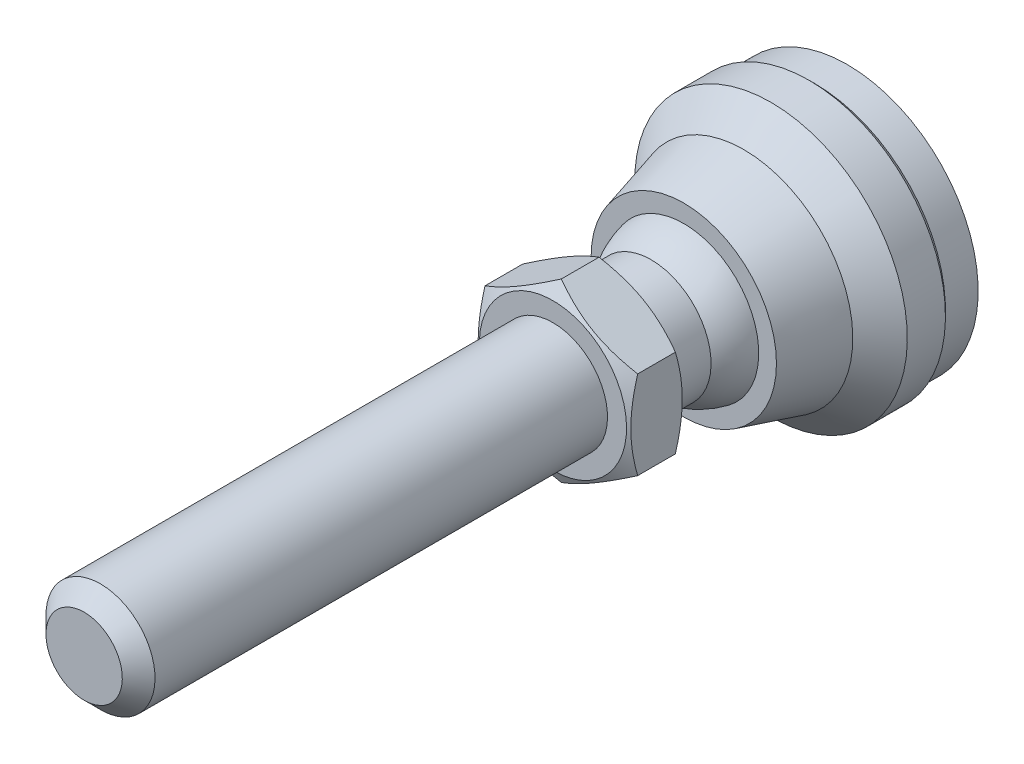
ISO-10303-21;
HEADER;
FILE_DESCRIPTION(('STEP AP214'),'2;1');
FILE_NAME('part.step','',(''),(''),'','','');
FILE_SCHEMA(('AUTOMOTIVE_DESIGN { 1 0 10303 214 1 1 1 1 }'));
ENDSEC;
DATA;
#1=APPLICATION_CONTEXT('core data for automotive mechanical design processes');
#2=APPLICATION_PROTOCOL_DEFINITION('international standard','automotive_design',2000,#1);
#3=PRODUCT_CONTEXT('',#1,'mechanical');
#4=PRODUCT('Part','Part','',(#3));
#5=PRODUCT_RELATED_PRODUCT_CATEGORY('part','',(#4));
#6=PRODUCT_DEFINITION_FORMATION('','',#4);
#7=PRODUCT_DEFINITION_CONTEXT('part definition',#1,'design');
#8=PRODUCT_DEFINITION('design','',#6,#7);
#9=PRODUCT_DEFINITION_SHAPE('','',#8);
#10=(LENGTH_UNIT() NAMED_UNIT(*) SI_UNIT(.MILLI.,.METRE.));
#11=(NAMED_UNIT(*) PLANE_ANGLE_UNIT() SI_UNIT($,.RADIAN.));
#12=(NAMED_UNIT(*) SI_UNIT($,.STERADIAN.) SOLID_ANGLE_UNIT());
#13=UNCERTAINTY_MEASURE_WITH_UNIT(LENGTH_MEASURE(1.E-05),#10,'distance_accuracy_value','');
#14=(GEOMETRIC_REPRESENTATION_CONTEXT(3) GLOBAL_UNCERTAINTY_ASSIGNED_CONTEXT((#13)) GLOBAL_UNIT_ASSIGNED_CONTEXT((#10,
#11,#12)) REPRESENTATION_CONTEXT('',''));
#15=CARTESIAN_POINT('',(0.,0.,0.));
#16=DIRECTION('',(0.,0.,1.));
#17=DIRECTION('',(1.,0.,0.));
#18=AXIS2_PLACEMENT_3D('',#15,#16,#17);
#19=CARTESIAN_POINT('',(-5.49999999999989,0.,22.));
#20=DIRECTION('',(0.,0.,1.));
#21=DIRECTION('',(0.,-1.,0.));
#22=AXIS2_PLACEMENT_3D('',#19,#20,#21);
#23=PLANE('',#22);
#24=CARTESIAN_POINT('',(0.,0.,21.9999999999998));
#25=DIRECTION('',(0.,0.,1.));
#26=DIRECTION('',(0.,-1.,0.));
#27=AXIS2_PLACEMENT_3D('',#24,#25,#26);
#28=CIRCLE('',#27,6.75);
#29=CARTESIAN_POINT('',(0.,-6.75,21.9999999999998));
#30=VERTEX_POINT('',#29);
#31=EDGE_CURVE('E440',#30,#30,#28,.T.);
#32=ORIENTED_EDGE('',*,*,#31,.F.);
#33=EDGE_LOOP('',(#32));
#34=FACE_BOUND('',#33,.T.);
#35=CARTESIAN_POINT('',(0.,0.,22.));
#36=DIRECTION('',(0.,0.,-1.));
#37=DIRECTION('',(0.,1.,0.));
#38=AXIS2_PLACEMENT_3D('',#35,#36,#37);
#39=CIRCLE('',#38,5.49999999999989);
#40=CARTESIAN_POINT('',(0.,5.49999999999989,22.));
#41=VERTEX_POINT('',#40);
#42=EDGE_CURVE('E120',#41,#41,#39,.T.);
#43=ORIENTED_EDGE('',*,*,#42,.F.);
#44=EDGE_LOOP('',(#43));
#45=FACE_BOUND('',#44,.T.);
#46=ADVANCED_FACE('F14',(#34,#45),#23,.F.);
#47=CARTESIAN_POINT('',(0.,0.,0.));
#48=DIRECTION('',(0.,0.,-1.));
#49=DIRECTION('',(0.,1.,0.));
#50=AXIS2_PLACEMENT_3D('',#47,#48,#49);
#51=CYLINDRICAL_SURFACE('',#50,5.49999999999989);
#52=CARTESIAN_POINT('',(0.,0.,18.));
#53=DIRECTION('',(0.,0.,-1.));
#54=DIRECTION('',(0.,1.,0.));
#55=AXIS2_PLACEMENT_3D('',#52,#53,#54);
#56=CIRCLE('',#55,5.49999999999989);
#57=CARTESIAN_POINT('',(-5.49999999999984,0.,18.));
#58=VERTEX_POINT('',#57);
#59=EDGE_CURVE('E117',#58,#58,#56,.T.);
#60=ORIENTED_EDGE('',*,*,#59,.F.);
#61=EDGE_LOOP('',(#60));
#62=FACE_BOUND('',#61,.T.);
#63=ORIENTED_EDGE('',*,*,#42,.T.);
#64=EDGE_LOOP('',(#63));
#65=FACE_BOUND('',#64,.T.);
#66=ADVANCED_FACE('F144',(#62,#65),#51,.T.);
#67=CARTESIAN_POINT('',(1.11022302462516E-13,0.,13.6698729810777));
#68=DIRECTION('',(0.,0.,-1.));
#69=DIRECTION('',(-1.,0.,0.));
#70=AXIS2_PLACEMENT_3D('',#67,#68,#69);
#71=SPHERICAL_SURFACE('',#70,7.);
#72=CARTESIAN_POINT('',(0.,0.,15.));
#73=DIRECTION('',(0.,0.,-1.));
#74=DIRECTION('',(0.,1.,0.));
#75=AXIS2_PLACEMENT_3D('',#72,#73,#74);
#76=CIRCLE('',#75,6.87246404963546);
#77=CARTESIAN_POINT('',(-6.87246404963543,0.,15.));
#78=VERTEX_POINT('',#77);
#79=EDGE_CURVE('E114',#78,#78,#76,.T.);
#80=CARTESIAN_POINT('',(-6.87246404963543,0.,15.));
#81=CARTESIAN_POINT('',(-6.86587210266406,0.,15.0340591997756));
#82=CARTESIAN_POINT('',(-6.85902692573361,0.,15.0680693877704));
#83=CARTESIAN_POINT('',(-6.84483171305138,0.,15.1359842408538));
#84=CARTESIAN_POINT('',(-6.8374816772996,0.,15.1698889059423));
#85=CARTESIAN_POINT('',(-6.82227834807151,0.,15.2375852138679));
#86=CARTESIAN_POINT('',(-6.8144250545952,0.,15.2713768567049));
#87=CARTESIAN_POINT('',(-6.79821695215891,0.,15.3388396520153));
#88=CARTESIAN_POINT('',(-6.78986214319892,0.,15.3725108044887));
#89=CARTESIAN_POINT('',(-6.77265285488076,0.,15.4397251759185));
#90=CARTESIAN_POINT('',(-6.76379837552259,0.,15.473268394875));
#91=CARTESIAN_POINT('',(-6.74559170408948,0.,15.5402194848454));
#92=CARTESIAN_POINT('',(-6.73623951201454,0.,15.5736273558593));
#93=CARTESIAN_POINT('',(-6.71703948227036,0.,15.6403003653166));
#94=CARTESIAN_POINT('',(-6.70719164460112,0.,15.67356550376));
#95=CARTESIAN_POINT('',(-6.68700250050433,0.,15.7399456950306));
#96=CARTESIAN_POINT('',(-6.67666119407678,0.,15.7730607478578));
#97=CARTESIAN_POINT('',(-6.65548739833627,0.,15.8391334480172));
#98=CARTESIAN_POINT('',(-6.6446549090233,0.,15.8720910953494));
#99=CARTESIAN_POINT('',(-6.62250114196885,0.,15.9378416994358));
#100=CARTESIAN_POINT('',(-6.61117986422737,0.,15.9706346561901));
#101=CARTESIAN_POINT('',(-6.58805102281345,0.,16.0360486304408));
#102=CARTESIAN_POINT('',(-6.57624345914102,0.,16.0686696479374));
#103=CARTESIAN_POINT('',(-6.55214465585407,0.,16.1337325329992));
#104=CARTESIAN_POINT('',(-6.53985341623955,0.,16.1661744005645));
#105=CARTESIAN_POINT('',(-6.51478997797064,0.,16.2308718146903));
#106=CARTESIAN_POINT('',(-6.50201777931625,0.,16.2631273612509));
#107=CARTESIAN_POINT('',(-6.47599524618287,0.,16.3274450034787));
#108=CARTESIAN_POINT('',(-6.46274491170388,0.,16.3595070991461));
#109=CARTESIAN_POINT('',(-6.43576903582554,0.,16.4234307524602));
#110=CARTESIAN_POINT('',(-6.42204349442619,0.,16.455292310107));
#111=CARTESIAN_POINT('',(-6.39412023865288,0.,16.5188078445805));
#112=CARTESIAN_POINT('',(-6.37992252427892,0.,16.5504618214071));
#113=CARTESIAN_POINT('',(-6.35105806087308,0.,16.6135551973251));
#114=CARTESIAN_POINT('',(-6.33639131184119,0.,16.6449945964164));
#115=CARTESIAN_POINT('',(-6.30659202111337,0.,16.7076518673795));
#116=CARTESIAN_POINT('',(-6.29145947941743,0.,16.7388697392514));
#117=CARTESIAN_POINT('',(-6.26073194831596,0.,16.8010770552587));
#118=CARTESIAN_POINT('',(-6.24513695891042,0.,16.8320664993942));
#119=CARTESIAN_POINT('',(-6.2134879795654,0.,16.8938101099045));
#120=CARTESIAN_POINT('',(-6.19743398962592,0.,16.9245642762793));
#121=CARTESIAN_POINT('',(-6.16487055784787,0.,16.9858305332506));
#122=CARTESIAN_POINT('',(-6.14836111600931,0.,17.016342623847));
#123=CARTESIAN_POINT('',(-6.11489042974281,0.,17.0771179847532));
#124=CARTESIAN_POINT('',(-6.09792918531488,0.,17.107381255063));
#125=CARTESIAN_POINT('',(-6.06355864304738,0.,17.1676522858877));
#126=CARTESIAN_POINT('',(-6.0461493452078,0.,17.1976600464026));
#127=CARTESIAN_POINT('',(-6.01088654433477,0.,17.2574134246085));
#128=CARTESIAN_POINT('',(-5.99303304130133,0.,17.2871590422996));
#129=CARTESIAN_POINT('',(-5.95688577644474,0.,17.3463815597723));
#130=CARTESIAN_POINT('',(-5.9385920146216,0.,17.3758584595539));
#131=CARTESIAN_POINT('',(-5.90156827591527,0.,17.4345370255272));
#132=CARTESIAN_POINT('',(-5.88283829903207,0.,17.4637386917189));
#133=CARTESIAN_POINT('',(-5.84494627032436,0.,17.5218603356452));
#134=CARTESIAN_POINT('',(-5.82578421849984,0.,17.5507803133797));
#135=CARTESIAN_POINT('',(-5.78703227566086,0.,17.6083321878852));
#136=CARTESIAN_POINT('',(-5.7674423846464,0.,17.6369640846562));
#137=CARTESIAN_POINT('',(-5.72783909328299,0.,17.6939334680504));
#138=CARTESIAN_POINT('',(-5.70782569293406,0.,17.7222709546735));
#139=CARTESIAN_POINT('',(-5.66737980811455,0.,17.778645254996));
#140=CARTESIAN_POINT('',(-5.64694732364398,0.,17.8066820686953));
#141=CARTESIAN_POINT('',(-5.60566778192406,0.,17.862448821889));
#142=CARTESIAN_POINT('',(-5.58482072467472,0.,17.8901787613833));
#143=CARTESIAN_POINT('',(-5.5427166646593,0.,17.9453256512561));
#144=CARTESIAN_POINT('',(-5.52145966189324,0.,17.9727426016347));
#145=CARTESIAN_POINT('',(-5.49999999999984,0.,18.));
#146=B_SPLINE_CURVE_WITH_KNOTS('',3,(#80,#81,#82,#83,#84,#85,#86,#87,#88,#89,#90,#91,#92,#93,
#94,#95,#96,#97,#98,#99,#100,#101,#102,#103,#104,#105,#106,#107,#108,#109,#110,#111,#112,#113,
#114,#115,#116,#117,#118,#119,#120,#121,#122,#123,#124,#125,#126,#127,#128,#129,#130,#131,#132,
#133,#134,#135,#136,#137,#138,#139,#140,#141,#142,#143,#144,#145),.UNSPECIFIED.,.F.,.F.,(4,2,2,
2,2,2,2,2,2,2,2,2,2,2,2,2,2,2,2,2,2,2,2,2,2,2,2,2,2,2,2,2,4),(0.,0.104072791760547,
0.208145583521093,0.312218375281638,0.416291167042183,0.520363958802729,0.624436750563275,
0.728509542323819,0.832582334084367,0.936655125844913,1.04072791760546,1.144800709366,
1.24887350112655,1.3529462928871,1.45701908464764,1.56109187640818,1.66516466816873,
1.76923745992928,1.87331025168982,1.97738304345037,2.08145583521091,2.18552862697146,
2.28960141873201,2.39367421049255,2.4977470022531,2.60181979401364,2.70589258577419,
2.80996537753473,2.91403816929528,3.01811096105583,3.12218375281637,3.22625654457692,
3.33032933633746),.UNSPECIFIED.);
#147=EDGE_CURVE('BSEAM151',#78,#58,#146,.T.);
#148=ORIENTED_EDGE('',*,*,#79,.F.);
#149=ORIENTED_EDGE('',*,*,#59,.T.);
#150=ORIENTED_EDGE('',*,*,#147,.T.);
#151=ORIENTED_EDGE('',*,*,#147,.F.);
#152=EDGE_LOOP('',(#148,#150,#149,#151));
#153=FACE_BOUND('',#152,.T.);
#154=ADVANCED_FACE('F151',(#153),#71,.T.);
#155=CARTESIAN_POINT('',(-8.5,0.,15.));
#156=DIRECTION('',(0.,0.,-1.));
#157=DIRECTION('',(0.,1.,0.));
#158=AXIS2_PLACEMENT_3D('',#155,#156,#157);
#159=PLANE('',#158);
#160=CARTESIAN_POINT('',(0.,0.,15.));
#161=DIRECTION('',(0.,0.,-1.));
#162=DIRECTION('',(0.,1.,0.));
#163=AXIS2_PLACEMENT_3D('',#160,#161,#162);
#164=CIRCLE('',#163,8.5);
#165=CARTESIAN_POINT('',(0.,8.5,15.));
#166=VERTEX_POINT('',#165);
#167=EDGE_CURVE('E111',#166,#166,#164,.T.);
#168=ORIENTED_EDGE('',*,*,#167,.F.);
#169=EDGE_LOOP('',(#168));
#170=FACE_BOUND('',#169,.T.);
#171=ORIENTED_EDGE('',*,*,#79,.T.);
#172=EDGE_LOOP('',(#171));
#173=FACE_BOUND('',#172,.T.);
#174=ADVANCED_FACE('F303',(#170,#173),#159,.F.);
#175=CARTESIAN_POINT('',(0.,0.,15.));
#176=DIRECTION('',(0.,0.,-1.));
#177=DIRECTION('',(0.,1.,0.));
#178=AXIS2_PLACEMENT_3D('',#175,#176,#177);
#179=CONICAL_SURFACE('',#178,8.5,0.266252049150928);
#180=CARTESIAN_POINT('',(0.,0.,9.5));
#181=DIRECTION('',(0.,0.,-1.));
#182=DIRECTION('',(0.,1.,0.));
#183=AXIS2_PLACEMENT_3D('',#180,#181,#182);
#184=CIRCLE('',#183,10.);
#185=CARTESIAN_POINT('',(0.,10.,9.5));
#186=VERTEX_POINT('',#185);
#187=EDGE_CURVE('E108',#186,#186,#184,.T.);
#188=ORIENTED_EDGE('',*,*,#187,.F.);
#189=EDGE_LOOP('',(#188));
#190=FACE_BOUND('',#189,.T.);
#191=ORIENTED_EDGE('',*,*,#167,.T.);
#192=EDGE_LOOP('',(#191));
#193=FACE_BOUND('',#192,.T.);
#194=ADVANCED_FACE('F293',(#190,#193),#179,.T.);
#195=CARTESIAN_POINT('',(0.,0.,9.5));
#196=DIRECTION('',(0.,0.,-1.));
#197=DIRECTION('',(0.,1.,0.));
#198=AXIS2_PLACEMENT_3D('',#195,#196,#197);
#199=CONICAL_SURFACE('',#198,10.,0.785398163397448);
#200=CARTESIAN_POINT('',(0.,0.,7.));
#201=DIRECTION('',(0.,0.,-1.));
#202=DIRECTION('',(0.,1.,0.));
#203=AXIS2_PLACEMENT_3D('',#200,#201,#202);
#204=CIRCLE('',#203,12.5);
#205=CARTESIAN_POINT('',(0.,12.5,7.));
#206=VERTEX_POINT('',#205);
#207=EDGE_CURVE('E105',#206,#206,#204,.T.);
#208=ORIENTED_EDGE('',*,*,#207,.F.);
#209=EDGE_LOOP('',(#208));
#210=FACE_BOUND('',#209,.T.);
#211=ORIENTED_EDGE('',*,*,#187,.T.);
#212=EDGE_LOOP('',(#211));
#213=FACE_BOUND('',#212,.T.);
#214=ADVANCED_FACE('F283',(#210,#213),#199,.T.);
#215=CARTESIAN_POINT('',(0.,0.,0.));
#216=DIRECTION('',(0.,0.,-1.));
#217=DIRECTION('',(0.,1.,0.));
#218=AXIS2_PLACEMENT_3D('',#215,#216,#217);
#219=CYLINDRICAL_SURFACE('',#218,12.5);
#220=CARTESIAN_POINT('',(0.,0.,3.5));
#221=DIRECTION('',(0.,0.,-1.));
#222=DIRECTION('',(0.,1.,0.));
#223=AXIS2_PLACEMENT_3D('',#220,#221,#222);
#224=CIRCLE('',#223,12.5);
#225=CARTESIAN_POINT('',(0.,12.5,3.5));
#226=VERTEX_POINT('',#225);
#227=EDGE_CURVE('E102',#226,#226,#224,.T.);
#228=ORIENTED_EDGE('',*,*,#227,.F.);
#229=EDGE_LOOP('',(#228));
#230=FACE_BOUND('',#229,.T.);
#231=ORIENTED_EDGE('',*,*,#207,.T.);
#232=EDGE_LOOP('',(#231));
#233=FACE_BOUND('',#232,.T.);
#234=ADVANCED_FACE('F273',(#230,#233),#219,.T.);
#235=CARTESIAN_POINT('',(0.,0.,3.5));
#236=DIRECTION('',(0.,0.,1.));
#237=DIRECTION('',(0.,-1.,0.));
#238=AXIS2_PLACEMENT_3D('',#235,#236,#237);
#239=CONICAL_SURFACE('',#238,12.5,0.785398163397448);
#240=CARTESIAN_POINT('',(0.,0.,3.));
#241=DIRECTION('',(0.,0.,-1.));
#242=DIRECTION('',(0.,1.,0.));
#243=AXIS2_PLACEMENT_3D('',#240,#241,#242);
#244=CIRCLE('',#243,12.);
#245=CARTESIAN_POINT('',(0.,12.,3.));
#246=VERTEX_POINT('',#245);
#247=EDGE_CURVE('E99',#246,#246,#244,.T.);
#248=ORIENTED_EDGE('',*,*,#247,.F.);
#249=EDGE_LOOP('',(#248));
#250=FACE_BOUND('',#249,.T.);
#251=ORIENTED_EDGE('',*,*,#227,.T.);
#252=EDGE_LOOP('',(#251));
#253=FACE_BOUND('',#252,.T.);
#254=ADVANCED_FACE('F263',(#250,#253),#239,.T.);
#255=CARTESIAN_POINT('',(0.,0.,0.));
#256=DIRECTION('',(0.,0.,-1.));
#257=DIRECTION('',(0.,1.,0.));
#258=AXIS2_PLACEMENT_3D('',#255,#256,#257);
#259=CYLINDRICAL_SURFACE('',#258,12.);
#260=CARTESIAN_POINT('',(0.,0.,0.));
#261=DIRECTION('',(0.,0.,-1.));
#262=DIRECTION('',(0.,1.,0.));
#263=AXIS2_PLACEMENT_3D('',#260,#261,#262);
#264=CIRCLE('',#263,12.);
#265=CARTESIAN_POINT('',(0.,12.,0.));
#266=VERTEX_POINT('',#265);
#267=EDGE_CURVE('E96',#266,#266,#264,.T.);
#268=ORIENTED_EDGE('',*,*,#267,.F.);
#269=EDGE_LOOP('',(#268));
#270=FACE_BOUND('',#269,.T.);
#271=ORIENTED_EDGE('',*,*,#247,.T.);
#272=EDGE_LOOP('',(#271));
#273=FACE_BOUND('',#272,.T.);
#274=ADVANCED_FACE('F252',(#270,#273),#259,.T.);
#275=CARTESIAN_POINT('',(-12.,0.,0.));
#276=DIRECTION('',(0.,0.,1.));
#277=DIRECTION('',(0.,-1.,0.));
#278=AXIS2_PLACEMENT_3D('',#275,#276,#277);
#279=PLANE('',#278);
#280=ORIENTED_EDGE('',*,*,#267,.T.);
#281=EDGE_LOOP('',(#280));
#282=FACE_BOUND('',#281,.T.);
#283=ADVANCED_FACE('F142',(#282),#279,.F.);
#284=CARTESIAN_POINT('',(0.,0.,21.9999999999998));
#285=DIRECTION('',(0.,0.,1.));
#286=DIRECTION('',(0.,-1.,0.));
#287=AXIS2_PLACEMENT_3D('',#284,#285,#286);
#288=CONICAL_SURFACE('',#287,6.75,1.0471975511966);
#289=CARTESIAN_POINT('',(0.000200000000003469,-8.08301923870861,22.7696190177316));
#290=CARTESIAN_POINT('',(-0.153667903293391,-7.99418356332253,22.7183374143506));
#291=CARTESIAN_POINT('',(-0.308109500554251,-7.9050166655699,22.6693831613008));
#292=CARTESIAN_POINT('',(-0.618246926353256,-7.72595873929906,22.5767703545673));
#293=CARTESIAN_POINT('',(-0.773943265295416,-7.63606741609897,22.5331140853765));
#294=CARTESIAN_POINT('',(-1.24352516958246,-7.36495417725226,22.4109491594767));
#295=CARTESIAN_POINT('',(-1.5592643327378,-7.18266208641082,22.3414631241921));
#296=CARTESIAN_POINT('',(-2.03176224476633,-6.90986528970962,22.2599825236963));
#297=CARTESIAN_POINT('',(-2.18710922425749,-6.8201756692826,22.2367710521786));
#298=CARTESIAN_POINT('',(-2.49850511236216,-6.64039116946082,22.1978487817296));
#299=CARTESIAN_POINT('',(-2.65455395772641,-6.55029632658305,22.1821373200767));
#300=CARTESIAN_POINT('',(-2.96692267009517,-6.36995016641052,22.1586154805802));
#301=CARTESIAN_POINT('',(-3.12324202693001,-6.27969914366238,22.15079613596));
#302=CARTESIAN_POINT('',(-3.43601650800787,-6.09911871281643,22.1432178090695));
#303=CARTESIAN_POINT('',(-3.59247162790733,-6.00878930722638,22.1434585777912));
#304=CARTESIAN_POINT('',(-4.02110687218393,-5.76131663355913,22.1551972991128));
#305=CARTESIAN_POINT('',(-4.2931466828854,-5.60425437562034,22.1749033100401));
#306=CARTESIAN_POINT('',(-4.8354194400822,-5.29117305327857,22.2373910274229));
#307=CARTESIAN_POINT('',(-5.10565047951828,-5.13515508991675,22.2801940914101));
#308=CARTESIAN_POINT('',(-5.64901454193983,-4.8214437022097,22.3871892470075));
#309=CARTESIAN_POINT('',(-5.92207900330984,-4.66378986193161,22.4518346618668));
#310=CARTESIAN_POINT('',(-6.46413578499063,-4.35083323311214,22.5985536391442));
#311=CARTESIAN_POINT('',(-6.73313504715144,-4.19552643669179,22.6805927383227));
#312=CARTESIAN_POINT('',(-7.0002,-4.04133641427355,22.7696190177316));
#313=B_SPLINE_CURVE_WITH_KNOTS('',3,(#289,#290,#291,#292,#293,#294,#295,#296,#297,#298,#299,
#300,#301,#302,#303,#304,#305,#306,#307,#308,#309,#310,#311,#312),.UNSPECIFIED.,.F.,.F.,(4,2,2,
2,2,2,2,2,2,2,2,4),(0.,0.554727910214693,1.10969417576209,2.2219327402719,2.76443041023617,
3.30688013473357,3.8487128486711,4.39052882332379,5.33376515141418,6.27787517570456,
7.2429241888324,8.20607866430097),.UNSPECIFIED.);
#314=CARTESIAN_POINT('',(0.,-8.08290376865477,22.7695523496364));
#315=VERTEX_POINT('',#314);
#316=CARTESIAN_POINT('',(-7.,-4.04145188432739,22.7695523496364));
#317=VERTEX_POINT('',#316);
#318=EDGE_CURVE('E73',#315,#317,#313,.T.);
#319=ORIENTED_EDGE('',*,*,#318,.T.);
#320=CARTESIAN_POINT('',(-7.,10.8277061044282,25.5468814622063));
#321=CARTESIAN_POINT('',(-7.,10.5222038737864,25.3987988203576));
#322=CARTESIAN_POINT('',(-7.,10.2159973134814,25.2521442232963));
#323=CARTESIAN_POINT('',(-7.,9.60180084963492,24.962494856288));
#324=CARTESIAN_POINT('',(-7.,9.29381067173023,24.8195006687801));
#325=CARTESIAN_POINT('',(-7.,8.67407191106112,24.5372504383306));
#326=CARTESIAN_POINT('',(-7.,8.36231197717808,24.3980192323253));
#327=CARTESIAN_POINT('',(-7.,7.73630264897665,24.1252923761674));
#328=CARTESIAN_POINT('',(-7.,7.42205337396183,23.9917964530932));
#329=CARTESIAN_POINT('',(-7.,6.78053297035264,23.7279288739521));
#330=CARTESIAN_POINT('',(-7.,6.45316516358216,23.5977909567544));
#331=CARTESIAN_POINT('',(-7.,5.79458999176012,23.3474326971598));
#332=CARTESIAN_POINT('',(-7.,5.4633821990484,23.2272134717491));
#333=CARTESIAN_POINT('',(-7.,4.79722517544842,22.9998695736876));
#334=CARTESIAN_POINT('',(-7.,4.46228517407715,22.8927181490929));
#335=CARTESIAN_POINT('',(-7.,3.78761294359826,22.6949652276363));
#336=CARTESIAN_POINT('',(-7.,3.44788226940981,22.604358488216));
#337=CARTESIAN_POINT('',(-7.,2.76525833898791,22.4445478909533));
#338=CARTESIAN_POINT('',(-7.,2.4223927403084,22.3752290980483));
#339=CARTESIAN_POINT('',(-7.,1.90499472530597,22.2902321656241));
#340=CARTESIAN_POINT('',(-7.,1.73199920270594,22.2650622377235));
#341=CARTESIAN_POINT('',(-7.,1.38515787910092,22.2215437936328));
#342=CARTESIAN_POINT('',(-7.,1.21131216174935,22.2031946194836));
#343=CARTESIAN_POINT('',(-7.,0.86526212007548,22.1739119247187));
#344=CARTESIAN_POINT('',(-7.,0.693065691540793,22.1628854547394));
#345=CARTESIAN_POINT('',(-7.,0.348360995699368,22.1481222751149));
#346=CARTESIAN_POINT('',(-7.,0.175852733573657,22.1443854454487));
#347=CARTESIAN_POINT('',(-7.,-0.169167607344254,22.1442906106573));
#348=CARTESIAN_POINT('',(-7.,-0.341679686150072,22.1479326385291));
#349=CARTESIAN_POINT('',(-7.,-0.686397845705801,22.1625069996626));
#350=CARTESIAN_POINT('',(-7.,-0.858603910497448,22.1734397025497));
#351=CARTESIAN_POINT('',(-7.,-1.27332271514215,22.2083173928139));
#352=CARTESIAN_POINT('',(-7.,-1.51554667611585,22.2357690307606));
#353=CARTESIAN_POINT('',(-7.,-1.99816689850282,22.3035926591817));
#354=CARTESIAN_POINT('',(-7.,-2.2385629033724,22.3439664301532));
#355=CARTESIAN_POINT('',(-7.,-2.95675087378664,22.4823275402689));
#356=CARTESIAN_POINT('',(-7.,-3.43126876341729,22.5975286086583));
#357=CARTESIAN_POINT('',(-7.,-4.14076439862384,22.7969229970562));
#358=CARTESIAN_POINT('',(-7.,-4.3794316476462,22.8687399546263));
#359=CARTESIAN_POINT('',(-7.,-4.85444737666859,23.0197397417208));
#360=CARTESIAN_POINT('',(-7.,-5.09079584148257,23.09892261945));
#361=CARTESIAN_POINT('',(-7.,-5.56125017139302,23.2633915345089));
#362=CARTESIAN_POINT('',(-7.,-5.79535676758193,23.3486754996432));
#363=CARTESIAN_POINT('',(-7.,-6.26163658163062,23.5243524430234));
#364=CARTESIAN_POINT('',(-7.,-6.49380982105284,23.6147453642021));
#365=CARTESIAN_POINT('',(-7.,-7.03732742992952,23.8321445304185));
#366=CARTESIAN_POINT('',(-7.,-7.3479700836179,23.9609017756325));
#367=CARTESIAN_POINT('',(-7.,-7.96665260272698,24.2245422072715));
#368=CARTESIAN_POINT('',(-7.,-8.27469231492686,24.3594257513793));
#369=CARTESIAN_POINT('',(-7.,-8.88864197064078,24.6341007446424));
#370=CARTESIAN_POINT('',(-7.,-9.19455148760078,24.7738931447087));
#371=CARTESIAN_POINT('',(-7.,-9.80454449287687,25.0574136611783));
#372=CARTESIAN_POINT('',(-7.,-10.1086279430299,25.2011418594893));
#373=CARTESIAN_POINT('',(-7.,-10.715574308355,25.4919503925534));
#374=CARTESIAN_POINT('',(-7.,-11.0184356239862,25.6390340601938));
#375=CARTESIAN_POINT('',(-7.,-11.6228616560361,25.9358442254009));
#376=CARTESIAN_POINT('',(-7.,-11.9244263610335,26.0855707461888));
#377=CARTESIAN_POINT('',(-7.,-12.8274050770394,26.5379792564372));
#378=CARTESIAN_POINT('',(-7.,-13.4271821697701,26.84392810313));
#379=CARTESIAN_POINT('',(-7.,-14.5740975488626,27.4364212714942));
#380=CARTESIAN_POINT('',(-7.,-15.1214884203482,27.7224788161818));
#381=CARTESIAN_POINT('',(-7.,-16.2142330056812,28.2985008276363));
#382=CARTESIAN_POINT('',(-7.,-16.759586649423,28.5884654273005));
#383=CARTESIAN_POINT('',(-7.,-17.8473768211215,29.1706654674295));
#384=CARTESIAN_POINT('',(-7.,-18.389817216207,29.4628936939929));
#385=CARTESIAN_POINT('',(-7.,-19.4733930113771,30.0496913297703));
#386=CARTESIAN_POINT('',(-7.,-20.0145284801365,30.3442606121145));
#387=CARTESIAN_POINT('',(-7.,-20.5551824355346,30.6397051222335));
#388=B_SPLINE_CURVE_WITH_KNOTS('',3,(#320,#321,#322,#323,#324,#325,#326,#327,#328,#329,#330,
#331,#332,#333,#334,#335,#336,#337,#338,#339,#340,#341,#342,#343,#344,#345,#346,#347,#348,#349,
#350,#351,#352,#353,#354,#355,#356,#357,#358,#359,#360,#361,#362,#363,#364,#365,#366,#367,#368,
#369,#370,#371,#372,#373,#374,#375,#376,#377,#378,#379,#380,#381,#382,#383,#384,#385,#386,#387),
.UNSPECIFIED.,.F.,.F.,(4,2,2,2,2,2,2,2,2,2,2,2,2,2,2,2,2,2,2,2,2,2,2,2,2,2,2,2,2,2,2,2,2,4),(0.,
1.01851182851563,2.0371847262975,3.06145103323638,4.08566854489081,5.1424024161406,
6.19925512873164,7.25390661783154,8.30822333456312,9.35674337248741,9.88108098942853,
10.4053680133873,10.9228659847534,11.440355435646,11.9578472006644,12.475365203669,
13.2062752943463,13.9372861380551,15.4001299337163,16.1477836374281,16.8954422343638,
17.6428480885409,18.3902455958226,19.3989664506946,20.4077462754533,21.4167226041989,
22.4257199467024,23.4357673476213,24.4458236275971,26.4656747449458,28.318545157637,
30.1714787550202,32.0199180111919,33.8682577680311),.UNSPECIFIED.);
#389=CARTESIAN_POINT('',(-7.,4.04145188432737,22.7695523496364));
#390=VERTEX_POINT('',#389);
#391=EDGE_CURVE('E81',#317,#390,#388,.F.);
#392=ORIENTED_EDGE('',*,*,#391,.T.);
#393=CARTESIAN_POINT('',(-7.0002,4.04133641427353,22.7696190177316));
#394=CARTESIAN_POINT('',(-6.84633209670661,4.13017208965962,22.7183374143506));
#395=CARTESIAN_POINT('',(-6.69189049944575,4.21933898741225,22.6693831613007));
#396=CARTESIAN_POINT('',(-6.38175307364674,4.39839691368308,22.5767703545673));
#397=CARTESIAN_POINT('',(-6.22605673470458,4.48828823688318,22.5331140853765));
#398=CARTESIAN_POINT('',(-5.75647483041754,4.75940147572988,22.4109491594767));
#399=CARTESIAN_POINT('',(-5.4407356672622,4.94169356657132,22.3414631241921));
#400=CARTESIAN_POINT('',(-4.96823775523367,5.21449036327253,22.2599825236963));
#401=CARTESIAN_POINT('',(-4.81289077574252,5.30417998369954,22.2367710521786));
#402=CARTESIAN_POINT('',(-4.50149488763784,5.48396448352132,22.1978487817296));
#403=CARTESIAN_POINT('',(-4.3454460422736,5.5740593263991,22.1821373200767));
#404=CARTESIAN_POINT('',(-4.03307732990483,5.75440548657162,22.1586154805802));
#405=CARTESIAN_POINT('',(-3.87675797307,5.84465650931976,22.15079613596));
#406=CARTESIAN_POINT('',(-3.56398349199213,6.02523694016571,22.1432178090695));
#407=CARTESIAN_POINT('',(-3.40752837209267,6.11556634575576,22.1434585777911));
#408=CARTESIAN_POINT('',(-2.97889312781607,6.36303901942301,22.1551972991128));
#409=CARTESIAN_POINT('',(-2.70685331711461,6.5201012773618,22.1749033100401));
#410=CARTESIAN_POINT('',(-2.16458055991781,6.83318259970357,22.2373910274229));
#411=CARTESIAN_POINT('',(-1.89434952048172,6.98920056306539,22.2801940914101));
#412=CARTESIAN_POINT('',(-1.35098545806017,7.30291195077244,22.3871892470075));
#413=CARTESIAN_POINT('',(-1.07792099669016,7.46056579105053,22.4518346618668));
#414=CARTESIAN_POINT('',(-0.535864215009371,7.77352241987,22.5985536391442));
#415=CARTESIAN_POINT('',(-0.26686495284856,7.92882921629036,22.6805927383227));
#416=CARTESIAN_POINT('',(0.000200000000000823,8.08301923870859,22.7696190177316));
#417=B_SPLINE_CURVE_WITH_KNOTS('',3,(#393,#394,#395,#396,#397,#398,#399,#400,#401,#402,#403,
#404,#405,#406,#407,#408,#409,#410,#411,#412,#413,#414,#415,#416),.UNSPECIFIED.,.F.,.F.,(4,2,2,
2,2,2,2,2,2,2,2,4),(0.,0.554727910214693,1.10969417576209,2.22193274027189,2.76443041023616,
3.30688013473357,3.84871284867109,4.39052882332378,5.33376515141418,6.27787517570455,
7.24292418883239,8.20607866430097),.UNSPECIFIED.);
#418=CARTESIAN_POINT('',(0.,8.08290376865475,22.7695523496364));
#419=VERTEX_POINT('',#418);
#420=EDGE_CURVE('E395',#390,#419,#417,.T.);
#421=ORIENTED_EDGE('',*,*,#420,.T.);
#422=CARTESIAN_POINT('',(-0.000199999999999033,8.08301923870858,22.7696190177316));
#423=CARTESIAN_POINT('',(0.153667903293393,7.9941835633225,22.7183374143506));
#424=CARTESIAN_POINT('',(0.308109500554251,7.90501666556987,22.6693831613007));
#425=CARTESIAN_POINT('',(0.618246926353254,7.72595873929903,22.5767703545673));
#426=CARTESIAN_POINT('',(0.773943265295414,7.63606741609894,22.5331140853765));
#427=CARTESIAN_POINT('',(1.24352516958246,7.36495417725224,22.4109491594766));
#428=CARTESIAN_POINT('',(1.5592643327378,7.1826620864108,22.3414631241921));
#429=CARTESIAN_POINT('',(2.03176224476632,6.90986528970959,22.2599825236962));
#430=CARTESIAN_POINT('',(2.18710922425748,6.82017566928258,22.2367710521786));
#431=CARTESIAN_POINT('',(2.49850511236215,6.6403911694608,22.1978487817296));
#432=CARTESIAN_POINT('',(2.6545539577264,6.55029632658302,22.1821373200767));
#433=CARTESIAN_POINT('',(2.96692267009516,6.3699501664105,22.1586154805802));
#434=CARTESIAN_POINT('',(3.12324202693,6.27969914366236,22.15079613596));
#435=CARTESIAN_POINT('',(3.43601650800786,6.09911871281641,22.1432178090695));
#436=CARTESIAN_POINT('',(3.59247162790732,6.00878930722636,22.1434585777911));
#437=CARTESIAN_POINT('',(4.02110687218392,5.76131663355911,22.1551972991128));
#438=CARTESIAN_POINT('',(4.29314668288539,5.60425437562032,22.1749033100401));
#439=CARTESIAN_POINT('',(4.83541944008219,5.29117305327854,22.2373910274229));
#440=CARTESIAN_POINT('',(5.10565047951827,5.13515508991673,22.2801940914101));
#441=CARTESIAN_POINT('',(5.64901454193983,4.82144370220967,22.3871892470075));
#442=CARTESIAN_POINT('',(5.92207900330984,4.66378986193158,22.4518346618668));
#443=CARTESIAN_POINT('',(6.46413578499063,4.35083323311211,22.5985536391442));
#444=CARTESIAN_POINT('',(6.73313504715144,4.19552643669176,22.6805927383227));
#445=CARTESIAN_POINT('',(7.0002,4.04133641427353,22.7696190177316));
#446=B_SPLINE_CURVE_WITH_KNOTS('',3,(#422,#423,#424,#425,#426,#427,#428,#429,#430,#431,#432,
#433,#434,#435,#436,#437,#438,#439,#440,#441,#442,#443,#444,#445),.UNSPECIFIED.,.F.,.F.,(4,2,2,
2,2,2,2,2,2,2,2,4),(0.,0.554727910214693,1.10969417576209,2.22193274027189,2.76443041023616,
3.30688013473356,3.84871284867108,4.39052882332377,5.33376515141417,6.27787517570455,
7.24292418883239,8.20607866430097),.UNSPECIFIED.);
#447=CARTESIAN_POINT('',(7.,4.04145188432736,22.7695523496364));
#448=VERTEX_POINT('',#447);
#449=EDGE_CURVE('E390',#419,#448,#446,.T.);
#450=ORIENTED_EDGE('',*,*,#449,.T.);
#451=CARTESIAN_POINT('',(7.,10.8277061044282,25.5468814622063));
#452=CARTESIAN_POINT('',(7.,10.5222038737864,25.3987988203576));
#453=CARTESIAN_POINT('',(7.,10.2159973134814,25.2521442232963));
#454=CARTESIAN_POINT('',(7.,9.60180084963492,24.962494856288));
#455=CARTESIAN_POINT('',(7.,9.29381067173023,24.8195006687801));
#456=CARTESIAN_POINT('',(7.,8.67407191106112,24.5372504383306));
#457=CARTESIAN_POINT('',(7.,8.36231197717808,24.3980192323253));
#458=CARTESIAN_POINT('',(7.,7.73630264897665,24.1252923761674));
#459=CARTESIAN_POINT('',(7.,7.42205337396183,23.9917964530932));
#460=CARTESIAN_POINT('',(7.,6.78053297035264,23.7279288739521));
#461=CARTESIAN_POINT('',(7.,6.45316516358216,23.5977909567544));
#462=CARTESIAN_POINT('',(7.,5.79458999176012,23.3474326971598));
#463=CARTESIAN_POINT('',(7.,5.4633821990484,23.2272134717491));
#464=CARTESIAN_POINT('',(7.,4.79722517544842,22.9998695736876));
#465=CARTESIAN_POINT('',(7.,4.46228517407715,22.8927181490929));
#466=CARTESIAN_POINT('',(7.,3.78761294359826,22.6949652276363));
#467=CARTESIAN_POINT('',(7.,3.44788226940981,22.604358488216));
#468=CARTESIAN_POINT('',(7.,2.76525833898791,22.4445478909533));
#469=CARTESIAN_POINT('',(7.,2.4223927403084,22.3752290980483));
#470=CARTESIAN_POINT('',(7.,1.90499472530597,22.2902321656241));
#471=CARTESIAN_POINT('',(7.,1.73199920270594,22.2650622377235));
#472=CARTESIAN_POINT('',(7.,1.38515787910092,22.2215437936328));
#473=CARTESIAN_POINT('',(7.,1.21131216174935,22.2031946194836));
#474=CARTESIAN_POINT('',(7.,0.86526212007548,22.1739119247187));
#475=CARTESIAN_POINT('',(7.,0.693065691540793,22.1628854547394));
#476=CARTESIAN_POINT('',(7.,0.348360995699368,22.1481222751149));
#477=CARTESIAN_POINT('',(7.,0.175852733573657,22.1443854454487));
#478=CARTESIAN_POINT('',(7.,-0.169167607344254,22.1442906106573));
#479=CARTESIAN_POINT('',(7.,-0.341679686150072,22.1479326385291));
#480=CARTESIAN_POINT('',(7.,-0.686397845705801,22.1625069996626));
#481=CARTESIAN_POINT('',(7.,-0.858603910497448,22.1734397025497));
#482=CARTESIAN_POINT('',(7.,-1.27332271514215,22.2083173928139));
#483=CARTESIAN_POINT('',(7.,-1.51554667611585,22.2357690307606));
#484=CARTESIAN_POINT('',(7.,-1.99816689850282,22.3035926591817));
#485=CARTESIAN_POINT('',(7.,-2.2385629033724,22.3439664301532));
#486=CARTESIAN_POINT('',(7.,-2.95675087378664,22.4823275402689));
#487=CARTESIAN_POINT('',(7.,-3.43126876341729,22.5975286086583));
#488=CARTESIAN_POINT('',(7.,-4.14076439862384,22.7969229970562));
#489=CARTESIAN_POINT('',(7.,-4.3794316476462,22.8687399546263));
#490=CARTESIAN_POINT('',(7.,-4.85444737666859,23.0197397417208));
#491=CARTESIAN_POINT('',(7.,-5.09079584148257,23.09892261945));
#492=CARTESIAN_POINT('',(7.,-5.56125017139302,23.2633915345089));
#493=CARTESIAN_POINT('',(7.,-5.79535676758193,23.3486754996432));
#494=CARTESIAN_POINT('',(7.,-6.26163658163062,23.5243524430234));
#495=CARTESIAN_POINT('',(7.,-6.49380982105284,23.6147453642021));
#496=CARTESIAN_POINT('',(7.,-7.03732742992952,23.8321445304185));
#497=CARTESIAN_POINT('',(7.,-7.3479700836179,23.9609017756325));
#498=CARTESIAN_POINT('',(7.,-7.96665260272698,24.2245422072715));
#499=CARTESIAN_POINT('',(7.,-8.27469231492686,24.3594257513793));
#500=CARTESIAN_POINT('',(7.,-8.88864197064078,24.6341007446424));
#501=CARTESIAN_POINT('',(7.,-9.19455148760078,24.7738931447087));
#502=CARTESIAN_POINT('',(7.,-9.80454449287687,25.0574136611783));
#503=CARTESIAN_POINT('',(7.,-10.1086279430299,25.2011418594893));
#504=CARTESIAN_POINT('',(7.,-10.715574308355,25.4919503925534));
#505=CARTESIAN_POINT('',(7.,-11.0184356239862,25.6390340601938));
#506=CARTESIAN_POINT('',(7.,-11.6228616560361,25.9358442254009));
#507=CARTESIAN_POINT('',(7.,-11.9244263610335,26.0855707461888));
#508=CARTESIAN_POINT('',(7.,-12.8274050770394,26.5379792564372));
#509=CARTESIAN_POINT('',(7.,-13.4271821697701,26.84392810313));
#510=CARTESIAN_POINT('',(7.,-14.5740975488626,27.4364212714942));
#511=CARTESIAN_POINT('',(7.,-15.1214884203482,27.7224788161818));
#512=CARTESIAN_POINT('',(7.,-16.2142330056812,28.2985008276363));
#513=CARTESIAN_POINT('',(7.,-16.759586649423,28.5884654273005));
#514=CARTESIAN_POINT('',(7.,-17.8473768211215,29.1706654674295));
#515=CARTESIAN_POINT('',(7.,-18.389817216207,29.4628936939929));
#516=CARTESIAN_POINT('',(7.,-19.4733930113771,30.0496913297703));
#517=CARTESIAN_POINT('',(7.,-20.0145284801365,30.3442606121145));
#518=CARTESIAN_POINT('',(7.,-20.5551824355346,30.6397051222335));
#519=B_SPLINE_CURVE_WITH_KNOTS('',3,(#451,#452,#453,#454,#455,#456,#457,#458,#459,#460,#461,
#462,#463,#464,#465,#466,#467,#468,#469,#470,#471,#472,#473,#474,#475,#476,#477,#478,#479,#480,
#481,#482,#483,#484,#485,#486,#487,#488,#489,#490,#491,#492,#493,#494,#495,#496,#497,#498,#499,
#500,#501,#502,#503,#504,#505,#506,#507,#508,#509,#510,#511,#512,#513,#514,#515,#516,#517,#518),
.UNSPECIFIED.,.F.,.F.,(4,2,2,2,2,2,2,2,2,2,2,2,2,2,2,2,2,2,2,2,2,2,2,2,2,2,2,2,2,2,2,2,2,4),(0.,
1.01851182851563,2.0371847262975,3.06145103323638,4.08566854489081,5.1424024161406,
6.19925512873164,7.25390661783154,8.30822333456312,9.35674337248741,9.88108098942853,
10.4053680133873,10.9228659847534,11.440355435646,11.9578472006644,12.475365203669,
13.2062752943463,13.9372861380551,15.4001299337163,16.1477836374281,16.8954422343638,
17.6428480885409,18.3902455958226,19.3989664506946,20.4077462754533,21.4167226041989,
22.4257199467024,23.4357673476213,24.4458236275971,26.4656747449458,28.318545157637,
30.1714787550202,32.0199180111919,33.8682577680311),.UNSPECIFIED.);
#520=CARTESIAN_POINT('',(7.,-4.04145188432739,22.7695523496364));
#521=VERTEX_POINT('',#520);
#522=EDGE_CURVE('E34',#448,#521,#519,.T.);
#523=ORIENTED_EDGE('',*,*,#522,.T.);
#524=CARTESIAN_POINT('',(7.0002,-4.04133641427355,22.7696190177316));
#525=CARTESIAN_POINT('',(6.84633209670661,-4.13017208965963,22.7183374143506));
#526=CARTESIAN_POINT('',(6.69189049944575,-4.21933898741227,22.6693831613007));
#527=CARTESIAN_POINT('',(6.38175307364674,-4.3983969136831,22.5767703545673));
#528=CARTESIAN_POINT('',(6.22605673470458,-4.48828823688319,22.5331140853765));
#529=CARTESIAN_POINT('',(5.75647483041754,-4.7594014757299,22.4109491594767));
#530=CARTESIAN_POINT('',(5.4407356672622,-4.94169356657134,22.3414631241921));
#531=CARTESIAN_POINT('',(4.96823775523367,-5.21449036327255,22.2599825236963));
#532=CARTESIAN_POINT('',(4.81289077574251,-5.30417998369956,22.2367710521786));
#533=CARTESIAN_POINT('',(4.50149488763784,-5.48396448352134,22.1978487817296));
#534=CARTESIAN_POINT('',(4.34544604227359,-5.57405932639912,22.1821373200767));
#535=CARTESIAN_POINT('',(4.03307732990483,-5.75440548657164,22.1586154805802));
#536=CARTESIAN_POINT('',(3.87675797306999,-5.84465650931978,22.15079613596));
#537=CARTESIAN_POINT('',(3.56398349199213,-6.02523694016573,22.1432178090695));
#538=CARTESIAN_POINT('',(3.40752837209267,-6.11556634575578,22.1434585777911));
#539=CARTESIAN_POINT('',(2.97889312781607,-6.36303901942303,22.1551972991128));
#540=CARTESIAN_POINT('',(2.70685331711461,-6.52010127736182,22.1749033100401));
#541=CARTESIAN_POINT('',(2.16458055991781,-6.83318259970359,22.2373910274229));
#542=CARTESIAN_POINT('',(1.89434952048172,-6.98920056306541,22.2801940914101));
#543=CARTESIAN_POINT('',(1.35098545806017,-7.30291195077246,22.3871892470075));
#544=CARTESIAN_POINT('',(1.07792099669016,-7.46056579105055,22.4518346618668));
#545=CARTESIAN_POINT('',(0.535864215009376,-7.77352241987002,22.5985536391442));
#546=CARTESIAN_POINT('',(0.266864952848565,-7.92882921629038,22.6805927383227));
#547=CARTESIAN_POINT('',(-0.000199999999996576,-8.08301923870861,22.7696190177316));
#548=B_SPLINE_CURVE_WITH_KNOTS('',3,(#524,#525,#526,#527,#528,#529,#530,#531,#532,#533,#534,
#535,#536,#537,#538,#539,#540,#541,#542,#543,#544,#545,#546,#547),.UNSPECIFIED.,.F.,.F.,(4,2,2,
2,2,2,2,2,2,2,2,4),(0.,0.554727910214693,1.10969417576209,2.2219327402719,2.76443041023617,
3.30688013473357,3.84871284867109,4.39052882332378,5.33376515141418,6.27787517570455,
7.24292418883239,8.20607866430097),.UNSPECIFIED.);
#549=EDGE_CURVE('E9',#521,#315,#548,.T.);
#550=ORIENTED_EDGE('',*,*,#549,.T.);
#551=EDGE_LOOP('',(#319,#392,#421,#450,#523,#550));
#552=FACE_BOUND('',#551,.T.);
#553=ORIENTED_EDGE('',*,*,#31,.T.);
#554=EDGE_LOOP('',(#553));
#555=FACE_BOUND('',#554,.T.);
#556=ADVANCED_FACE('F71',(#552,#555),#288,.T.);
#557=CARTESIAN_POINT('',(-3.49999999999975,0.,70.));
#558=DIRECTION('',(0.,0.,-1.));
#559=DIRECTION('',(0.,1.,0.));
#560=AXIS2_PLACEMENT_3D('',#557,#558,#559);
#561=PLANE('',#560);
#562=CARTESIAN_POINT('',(0.,0.,70.));
#563=DIRECTION('',(0.,0.,-1.));
#564=DIRECTION('',(0.,1.,0.));
#565=AXIS2_PLACEMENT_3D('',#562,#563,#564);
#566=CIRCLE('',#565,3.49999999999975);
#567=CARTESIAN_POINT('',(0.,3.49999999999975,70.));
#568=VERTEX_POINT('',#567);
#569=EDGE_CURVE('E28',#568,#568,#566,.T.);
#570=ORIENTED_EDGE('',*,*,#569,.F.);
#571=EDGE_LOOP('',(#570));
#572=FACE_BOUND('',#571,.T.);
#573=ADVANCED_FACE('F16',(#572),#561,.F.);
#574=CARTESIAN_POINT('',(0.,0.,70.));
#575=DIRECTION('',(0.,0.,-1.));
#576=DIRECTION('',(0.,1.,0.));
#577=AXIS2_PLACEMENT_3D('',#574,#575,#576);
#578=CONICAL_SURFACE('',#577,3.49999999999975,0.785398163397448);
#579=CARTESIAN_POINT('',(0.,0.,68.5));
#580=DIRECTION('',(0.,0.,-1.));
#581=DIRECTION('',(0.,1.,0.));
#582=AXIS2_PLACEMENT_3D('',#579,#580,#581);
#583=CIRCLE('',#582,4.99999999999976);
#584=CARTESIAN_POINT('',(0.,4.99999999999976,68.5));
#585=VERTEX_POINT('',#584);
#586=EDGE_CURVE('E126',#585,#585,#583,.T.);
#587=ORIENTED_EDGE('',*,*,#586,.F.);
#588=EDGE_LOOP('',(#587));
#589=FACE_BOUND('',#588,.T.);
#590=ORIENTED_EDGE('',*,*,#569,.T.);
#591=EDGE_LOOP('',(#590));
#592=FACE_BOUND('',#591,.T.);
#593=ADVANCED_FACE('F131',(#589,#592),#578,.T.);
#594=CARTESIAN_POINT('',(0.,0.,0.));
#595=DIRECTION('',(0.,0.,-1.));
#596=DIRECTION('',(0.,1.,0.));
#597=AXIS2_PLACEMENT_3D('',#594,#595,#596);
#598=CYLINDRICAL_SURFACE('',#597,4.99999999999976);
#599=CARTESIAN_POINT('',(0.,0.,27.));
#600=DIRECTION('',(0.,0.,-1.));
#601=DIRECTION('',(0.,1.,0.));
#602=AXIS2_PLACEMENT_3D('',#599,#600,#601);
#603=CIRCLE('',#602,4.99999999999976);
#604=CARTESIAN_POINT('',(0.,4.99999999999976,27.));
#605=VERTEX_POINT('',#604);
#606=EDGE_CURVE('E123',#605,#605,#603,.T.);
#607=ORIENTED_EDGE('',*,*,#606,.F.);
#608=EDGE_LOOP('',(#607));
#609=FACE_BOUND('',#608,.T.);
#610=ORIENTED_EDGE('',*,*,#586,.T.);
#611=EDGE_LOOP('',(#610));
#612=FACE_BOUND('',#611,.T.);
#613=ADVANCED_FACE('F140',(#609,#612),#598,.T.);
#614=CARTESIAN_POINT('',(-4.99999999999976,0.,27.));
#615=DIRECTION('',(0.,0.,-1.));
#616=DIRECTION('',(0.,1.,0.));
#617=AXIS2_PLACEMENT_3D('',#614,#615,#616);
#618=PLANE('',#617);
#619=CARTESIAN_POINT('',(0.,0.,27.));
#620=DIRECTION('',(0.,0.,1.));
#621=DIRECTION('',(0.,-1.,0.));
#622=AXIS2_PLACEMENT_3D('',#619,#620,#621);
#623=CIRCLE('',#622,6.75);
#624=CARTESIAN_POINT('',(0.,-6.75,27.));
#625=VERTEX_POINT('',#624);
#626=EDGE_CURVE('E80',#625,#625,#623,.T.);
#627=ORIENTED_EDGE('',*,*,#626,.T.);
#628=EDGE_LOOP('',(#627));
#629=FACE_BOUND('',#628,.T.);
#630=ORIENTED_EDGE('',*,*,#606,.T.);
#631=EDGE_LOOP('',(#630));
#632=FACE_BOUND('',#631,.T.);
#633=ADVANCED_FACE('F158',(#629,#632),#618,.F.);
#634=CARTESIAN_POINT('',(0.,0.,25.3017154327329));
#635=DIRECTION('',(0.,0.,-1.));
#636=DIRECTION('',(0.,1.,0.));
#637=AXIS2_PLACEMENT_3D('',#634,#635,#636);
#638=CONICAL_SURFACE('',#637,9.69151515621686,1.0471975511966);
#639=CARTESIAN_POINT('',(-7.0002,-4.04133641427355,26.2303809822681));
#640=CARTESIAN_POINT('',(-6.84633209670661,-4.13017208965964,26.2816625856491));
#641=CARTESIAN_POINT('',(-6.69189049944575,-4.21933898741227,26.330616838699));
#642=CARTESIAN_POINT('',(-6.38175307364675,-4.3983969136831,26.4232296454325));
#643=CARTESIAN_POINT('',(-6.22605673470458,-4.4882882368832,26.4668859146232));
#644=CARTESIAN_POINT('',(-5.75647483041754,-4.7594014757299,26.5890508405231));
#645=CARTESIAN_POINT('',(-5.4407356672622,-4.94169356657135,26.6585368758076));
#646=CARTESIAN_POINT('',(-4.96823775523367,-5.21449036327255,26.7400174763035));
#647=CARTESIAN_POINT('',(-4.81289077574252,-5.30417998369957,26.7632289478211));
#648=CARTESIAN_POINT('',(-4.50149488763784,-5.48396448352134,26.8021512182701));
#649=CARTESIAN_POINT('',(-4.34544604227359,-5.57405932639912,26.8178626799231));
#650=CARTESIAN_POINT('',(-4.03307732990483,-5.75440548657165,26.8413845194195));
#651=CARTESIAN_POINT('',(-3.87675797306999,-5.84465650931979,26.8492038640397));
#652=CARTESIAN_POINT('',(-3.56398349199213,-6.02523694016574,26.8567821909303));
#653=CARTESIAN_POINT('',(-3.40752837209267,-6.11556634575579,26.8565414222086));
#654=CARTESIAN_POINT('',(-2.97889312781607,-6.36303901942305,26.844802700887));
#655=CARTESIAN_POINT('',(-2.7068533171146,-6.52010127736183,26.8250966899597));
#656=CARTESIAN_POINT('',(-2.1645805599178,-6.8331825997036,26.7626089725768));
#657=CARTESIAN_POINT('',(-1.89434952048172,-6.98920056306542,26.7198059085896));
#658=CARTESIAN_POINT('',(-1.35098545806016,-7.30291195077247,26.6128107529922));
#659=CARTESIAN_POINT('',(-1.07792099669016,-7.46056579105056,26.5481653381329));
#660=CARTESIAN_POINT('',(-0.535864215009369,-7.77352241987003,26.4014463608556));
#661=CARTESIAN_POINT('',(-0.266864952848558,-7.92882921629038,26.319407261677));
#662=CARTESIAN_POINT('',(0.000200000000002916,-8.08301923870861,26.2303809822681));
#663=B_SPLINE_CURVE_WITH_KNOTS('',3,(#639,#640,#641,#642,#643,#644,#645,#646,#647,#648,#649,
#650,#651,#652,#653,#654,#655,#656,#657,#658,#659,#660,#661,#662),.UNSPECIFIED.,.F.,.F.,(4,2,2,
2,2,2,2,2,2,2,2,4),(0.,0.554727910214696,1.10969417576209,2.2219327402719,2.76443041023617,
3.30688013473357,3.8487128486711,4.39052882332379,5.33376515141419,6.27787517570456,
7.2429241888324,8.20607866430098),.UNSPECIFIED.);
#664=CARTESIAN_POINT('',(-7.,-4.04145188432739,26.2304476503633));
#665=VERTEX_POINT('',#664);
#666=CARTESIAN_POINT('',(0.,-8.08290376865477,26.2304476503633));
#667=VERTEX_POINT('',#666);
#668=EDGE_CURVE('E88',#665,#667,#663,.T.);
#669=ORIENTED_EDGE('',*,*,#668,.T.);
#670=CARTESIAN_POINT('',(-0.000199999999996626,-8.08301923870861,26.2303809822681));
#671=CARTESIAN_POINT('',(0.153667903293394,-7.99418356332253,26.2816625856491));
#672=CARTESIAN_POINT('',(0.308109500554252,-7.90501666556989,26.330616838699));
#673=CARTESIAN_POINT('',(0.618246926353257,-7.72595873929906,26.4232296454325));
#674=CARTESIAN_POINT('',(0.773943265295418,-7.63606741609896,26.4668859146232));
#675=CARTESIAN_POINT('',(1.24352516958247,-7.36495417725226,26.5890508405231));
#676=CARTESIAN_POINT('',(1.5592643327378,-7.18266208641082,26.6585368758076));
#677=CARTESIAN_POINT('',(2.03176224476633,-6.90986528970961,26.7400174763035));
#678=CARTESIAN_POINT('',(2.18710922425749,-6.82017566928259,26.7632289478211));
#679=CARTESIAN_POINT('',(2.49850511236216,-6.64039116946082,26.8021512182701));
#680=CARTESIAN_POINT('',(2.65455395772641,-6.55029632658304,26.8178626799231));
#681=CARTESIAN_POINT('',(2.96692267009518,-6.36995016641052,26.8413845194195));
#682=CARTESIAN_POINT('',(3.12324202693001,-6.27969914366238,26.8492038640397));
#683=CARTESIAN_POINT('',(3.43601650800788,-6.09911871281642,26.8567821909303));
#684=CARTESIAN_POINT('',(3.59247162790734,-6.00878930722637,26.8565414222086));
#685=CARTESIAN_POINT('',(4.02110687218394,-5.76131663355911,26.844802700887));
#686=CARTESIAN_POINT('',(4.2931466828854,-5.60425437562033,26.8250966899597));
#687=CARTESIAN_POINT('',(4.8354194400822,-5.29117305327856,26.7626089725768));
#688=CARTESIAN_POINT('',(5.10565047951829,-5.13515508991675,26.7198059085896));
#689=CARTESIAN_POINT('',(5.64901454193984,-4.82144370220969,26.6128107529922));
#690=CARTESIAN_POINT('',(5.92207900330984,-4.6637898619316,26.5481653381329));
#691=CARTESIAN_POINT('',(6.46413578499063,-4.35083323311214,26.4014463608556));
#692=CARTESIAN_POINT('',(6.73313504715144,-4.19552643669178,26.319407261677));
#693=CARTESIAN_POINT('',(7.0002,-4.04133641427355,26.2303809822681));
#694=B_SPLINE_CURVE_WITH_KNOTS('',3,(#670,#671,#672,#673,#674,#675,#676,#677,#678,#679,#680,
#681,#682,#683,#684,#685,#686,#687,#688,#689,#690,#691,#692,#693),.UNSPECIFIED.,.F.,.F.,(4,2,2,
2,2,2,2,2,2,2,2,4),(0.,0.554727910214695,1.10969417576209,2.2219327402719,2.76443041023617,
3.30688013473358,3.8487128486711,4.39052882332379,5.33376515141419,6.27787517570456,
7.2429241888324,8.20607866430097),.UNSPECIFIED.);
#695=CARTESIAN_POINT('',(7.,-4.04145188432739,26.2304476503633));
#696=VERTEX_POINT('',#695);
#697=EDGE_CURVE('E86',#667,#696,#694,.T.);
#698=ORIENTED_EDGE('',*,*,#697,.T.);
#699=CARTESIAN_POINT('',(7.,10.8277061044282,23.4531185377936));
#700=CARTESIAN_POINT('',(7.,10.5222038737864,23.6012011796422));
#701=CARTESIAN_POINT('',(7.,10.2159973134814,23.7478557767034));
#702=CARTESIAN_POINT('',(7.,9.60180084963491,24.0375051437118));
#703=CARTESIAN_POINT('',(7.,9.29381067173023,24.1804993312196));
#704=CARTESIAN_POINT('',(7.,8.67407191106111,24.4627495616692));
#705=CARTESIAN_POINT('',(7.,8.36231197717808,24.6019807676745));
#706=CARTESIAN_POINT('',(7.,7.73630264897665,24.8747076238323));
#707=CARTESIAN_POINT('',(7.,7.42205337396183,25.0082035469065));
#708=CARTESIAN_POINT('',(7.,6.78053297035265,25.2720711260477));
#709=CARTESIAN_POINT('',(7.,6.45316516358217,25.4022090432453));
#710=CARTESIAN_POINT('',(7.,5.79458999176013,25.6525673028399));
#711=CARTESIAN_POINT('',(7.,5.46338219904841,25.7727865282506));
#712=CARTESIAN_POINT('',(7.,4.79722517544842,26.0001304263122));
#713=CARTESIAN_POINT('',(7.,4.46228517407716,26.1072818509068));
#714=CARTESIAN_POINT('',(7.,3.78761294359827,26.3050347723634));
#715=CARTESIAN_POINT('',(7.,3.44788226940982,26.3956415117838));
#716=CARTESIAN_POINT('',(7.,2.76525833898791,26.5554521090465));
#717=CARTESIAN_POINT('',(7.,2.4223927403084,26.6247709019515));
#718=CARTESIAN_POINT('',(7.,1.90499472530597,26.7097678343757));
#719=CARTESIAN_POINT('',(7.,1.73199920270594,26.7349377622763));
#720=CARTESIAN_POINT('',(7.,1.38515787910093,26.778456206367));
#721=CARTESIAN_POINT('',(7.,1.21131216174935,26.7968053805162));
#722=CARTESIAN_POINT('',(7.,0.865262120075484,26.826088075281));
#723=CARTESIAN_POINT('',(7.,0.693065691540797,26.8371145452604));
#724=CARTESIAN_POINT('',(7.,0.348360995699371,26.8518777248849));
#725=CARTESIAN_POINT('',(7.,0.17585273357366,26.8556145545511));
#726=CARTESIAN_POINT('',(7.,-0.169167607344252,26.8557093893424));
#727=CARTESIAN_POINT('',(7.,-0.341679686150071,26.8520673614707));
#728=CARTESIAN_POINT('',(7.,-0.686397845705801,26.8374930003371));
#729=CARTESIAN_POINT('',(7.,-0.858603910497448,26.8265602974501));
#730=CARTESIAN_POINT('',(7.,-1.27332271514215,26.7916826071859));
#731=CARTESIAN_POINT('',(7.,-1.51554667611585,26.7642309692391));
#732=CARTESIAN_POINT('',(7.,-1.99816689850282,26.6964073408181));
#733=CARTESIAN_POINT('',(7.,-2.2385629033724,26.6560335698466));
#734=CARTESIAN_POINT('',(7.,-2.95675087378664,26.5176724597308));
#735=CARTESIAN_POINT('',(7.,-3.43126876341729,26.4024713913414));
#736=CARTESIAN_POINT('',(7.,-4.14076439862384,26.2030770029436));
#737=CARTESIAN_POINT('',(7.,-4.3794316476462,26.1312600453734));
#738=CARTESIAN_POINT('',(7.,-4.85444737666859,25.9802602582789));
#739=CARTESIAN_POINT('',(7.,-5.09079584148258,25.9010773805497));
#740=CARTESIAN_POINT('',(7.,-5.56125017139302,25.7366084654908));
#741=CARTESIAN_POINT('',(7.,-5.79535676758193,25.6513245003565));
#742=CARTESIAN_POINT('',(7.,-6.26163658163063,25.4756475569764));
#743=CARTESIAN_POINT('',(7.,-6.49380982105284,25.3852546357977));
#744=CARTESIAN_POINT('',(7.,-7.03732742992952,25.1678554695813));
#745=CARTESIAN_POINT('',(7.,-7.34797008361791,25.0390982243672));
#746=CARTESIAN_POINT('',(7.,-7.966652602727,24.7754577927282));
#747=CARTESIAN_POINT('',(7.,-8.27469231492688,24.6405742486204));
#748=CARTESIAN_POINT('',(7.,-8.8886419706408,24.3658992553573));
#749=CARTESIAN_POINT('',(7.,-9.1945514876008,24.226106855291));
#750=CARTESIAN_POINT('',(7.,-9.80454449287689,23.9425863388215));
#751=CARTESIAN_POINT('',(7.,-10.10862794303,23.7988581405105));
#752=CARTESIAN_POINT('',(7.,-10.7155743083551,23.5080496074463));
#753=CARTESIAN_POINT('',(7.,-11.0184356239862,23.360965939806));
#754=CARTESIAN_POINT('',(7.,-11.6228616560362,23.0641557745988));
#755=CARTESIAN_POINT('',(7.,-11.9244263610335,22.9144292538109));
#756=CARTESIAN_POINT('',(7.,-12.8274050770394,22.4620207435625));
#757=CARTESIAN_POINT('',(7.,-13.4271821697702,22.1560718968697));
#758=CARTESIAN_POINT('',(7.,-14.5740975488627,21.5635787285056));
#759=CARTESIAN_POINT('',(7.,-15.1214884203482,21.277521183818));
#760=CARTESIAN_POINT('',(7.,-16.2142330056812,20.7014991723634));
#761=CARTESIAN_POINT('',(7.,-16.7595866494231,20.4115345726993));
#762=CARTESIAN_POINT('',(7.,-17.8473768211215,19.8293345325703));
#763=CARTESIAN_POINT('',(7.,-18.389817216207,19.5371063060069));
#764=CARTESIAN_POINT('',(7.,-19.4733930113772,18.9503086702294));
#765=CARTESIAN_POINT('',(7.,-20.0145284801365,18.6557393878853));
#766=CARTESIAN_POINT('',(7.,-20.5551824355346,18.3602948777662));
#767=B_SPLINE_CURVE_WITH_KNOTS('',3,(#699,#700,#701,#702,#703,#704,#705,#706,#707,#708,#709,
#710,#711,#712,#713,#714,#715,#716,#717,#718,#719,#720,#721,#722,#723,#724,#725,#726,#727,#728,
#729,#730,#731,#732,#733,#734,#735,#736,#737,#738,#739,#740,#741,#742,#743,#744,#745,#746,#747,
#748,#749,#750,#751,#752,#753,#754,#755,#756,#757,#758,#759,#760,#761,#762,#763,#764,#765,#766),
.UNSPECIFIED.,.F.,.F.,(4,2,2,2,2,2,2,2,2,2,2,2,2,2,2,2,2,2,2,2,2,2,2,2,2,2,2,2,2,2,2,2,2,4),(0.,
1.01851182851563,2.03718472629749,3.06145103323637,4.08566854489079,5.14240241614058,
6.19925512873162,7.25390661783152,8.30822333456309,9.3567433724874,9.88108098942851,
10.4053680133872,10.9228659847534,11.440355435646,11.9578472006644,12.475365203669,
13.2062752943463,13.937286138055,15.4001299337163,16.1477836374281,16.8954422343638,
17.6428480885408,18.3902455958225,19.3989664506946,20.4077462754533,21.4167226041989,
22.4257199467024,23.4357673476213,24.4458236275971,26.4656747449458,28.318545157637,
30.1714787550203,32.0199180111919,33.8682577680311),.UNSPECIFIED.);
#768=CARTESIAN_POINT('',(7.,4.04145188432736,26.2304476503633));
#769=VERTEX_POINT('',#768);
#770=EDGE_CURVE('E435',#696,#769,#767,.F.);
#771=ORIENTED_EDGE('',*,*,#770,.T.);
#772=CARTESIAN_POINT('',(7.0002,4.04133641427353,26.2303809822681));
#773=CARTESIAN_POINT('',(6.84633209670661,4.13017208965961,26.2816625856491));
#774=CARTESIAN_POINT('',(6.69189049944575,4.21933898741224,26.330616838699));
#775=CARTESIAN_POINT('',(6.38175307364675,4.39839691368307,26.4232296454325));
#776=CARTESIAN_POINT('',(6.22605673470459,4.48828823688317,26.4668859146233));
#777=CARTESIAN_POINT('',(5.75647483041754,4.75940147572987,26.5890508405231));
#778=CARTESIAN_POINT('',(5.4407356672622,4.94169356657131,26.6585368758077));
#779=CARTESIAN_POINT('',(4.96823775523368,5.21449036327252,26.7400174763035));
#780=CARTESIAN_POINT('',(4.81289077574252,5.30417998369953,26.7632289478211));
#781=CARTESIAN_POINT('',(4.50149488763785,5.48396448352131,26.8021512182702));
#782=CARTESIAN_POINT('',(4.3454460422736,5.57405932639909,26.8178626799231));
#783=CARTESIAN_POINT('',(4.03307732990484,5.75440548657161,26.8413845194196));
#784=CARTESIAN_POINT('',(3.87675797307,5.84465650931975,26.8492038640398));
#785=CARTESIAN_POINT('',(3.56398349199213,6.0252369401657,26.8567821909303));
#786=CARTESIAN_POINT('',(3.40752837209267,6.11556634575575,26.8565414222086));
#787=CARTESIAN_POINT('',(2.97889312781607,6.36303901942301,26.844802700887));
#788=CARTESIAN_POINT('',(2.70685331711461,6.52010127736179,26.8250966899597));
#789=CARTESIAN_POINT('',(2.16458055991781,6.83318259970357,26.7626089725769));
#790=CARTESIAN_POINT('',(1.89434952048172,6.98920056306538,26.7198059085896));
#791=CARTESIAN_POINT('',(1.35098545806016,7.30291195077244,26.6128107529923));
#792=CARTESIAN_POINT('',(1.07792099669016,7.46056579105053,26.548165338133));
#793=CARTESIAN_POINT('',(0.535864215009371,7.77352241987,26.4014463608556));
#794=CARTESIAN_POINT('',(0.26686495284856,7.92882921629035,26.319407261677));
#795=CARTESIAN_POINT('',(-0.000199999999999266,8.08301923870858,26.2303809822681));
#796=B_SPLINE_CURVE_WITH_KNOTS('',3,(#772,#773,#774,#775,#776,#777,#778,#779,#780,#781,#782,
#783,#784,#785,#786,#787,#788,#789,#790,#791,#792,#793,#794,#795),.UNSPECIFIED.,.F.,.F.,(4,2,2,
2,2,2,2,2,2,2,2,4),(0.,0.554727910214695,1.10969417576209,2.2219327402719,2.76443041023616,
3.30688013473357,3.84871284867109,4.39052882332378,5.33376515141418,6.27787517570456,
7.2429241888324,8.20607866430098),.UNSPECIFIED.);
#797=CARTESIAN_POINT('',(0.,8.08290376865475,26.2304476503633));
#798=VERTEX_POINT('',#797);
#799=EDGE_CURVE('E412',#769,#798,#796,.T.);
#800=ORIENTED_EDGE('',*,*,#799,.T.);
#801=CARTESIAN_POINT('',(0.000200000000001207,8.08301923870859,26.2303809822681));
#802=CARTESIAN_POINT('',(-0.153667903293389,7.99418356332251,26.2816625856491));
#803=CARTESIAN_POINT('',(-0.308109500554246,7.90501666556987,26.330616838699));
#804=CARTESIAN_POINT('',(-0.61824692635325,7.72595873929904,26.4232296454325));
#805=CARTESIAN_POINT('',(-0.773943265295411,7.63606741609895,26.4668859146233));
#806=CARTESIAN_POINT('',(-1.24352516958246,7.36495417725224,26.5890508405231));
#807=CARTESIAN_POINT('',(-1.5592643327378,7.1826620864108,26.6585368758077));
#808=CARTESIAN_POINT('',(-2.03176224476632,6.90986528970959,26.7400174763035));
#809=CARTESIAN_POINT('',(-2.18710922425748,6.82017566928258,26.7632289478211));
#810=CARTESIAN_POINT('',(-2.49850511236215,6.6403911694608,26.8021512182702));
#811=CARTESIAN_POINT('',(-2.6545539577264,6.55029632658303,26.8178626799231));
#812=CARTESIAN_POINT('',(-2.96692267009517,6.3699501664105,26.8413845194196));
#813=CARTESIAN_POINT('',(-3.12324202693,6.27969914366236,26.8492038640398));
#814=CARTESIAN_POINT('',(-3.43601650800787,6.09911871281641,26.8567821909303));
#815=CARTESIAN_POINT('',(-3.59247162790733,6.00878930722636,26.8565414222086));
#816=CARTESIAN_POINT('',(-4.02110687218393,5.76131663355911,26.844802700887));
#817=CARTESIAN_POINT('',(-4.29314668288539,5.60425437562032,26.8250966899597));
#818=CARTESIAN_POINT('',(-4.83541944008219,5.29117305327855,26.7626089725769));
#819=CARTESIAN_POINT('',(-5.10565047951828,5.13515508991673,26.7198059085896));
#820=CARTESIAN_POINT('',(-5.64901454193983,4.82144370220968,26.6128107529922));
#821=CARTESIAN_POINT('',(-5.92207900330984,4.66378986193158,26.5481653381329));
#822=CARTESIAN_POINT('',(-6.46413578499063,4.35083323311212,26.4014463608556));
#823=CARTESIAN_POINT('',(-6.73313504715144,4.19552643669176,26.319407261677));
#824=CARTESIAN_POINT('',(-7.0002,4.04133641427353,26.2303809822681));
#825=B_SPLINE_CURVE_WITH_KNOTS('',3,(#801,#802,#803,#804,#805,#806,#807,#808,#809,#810,#811,
#812,#813,#814,#815,#816,#817,#818,#819,#820,#821,#822,#823,#824),.UNSPECIFIED.,.F.,.F.,(4,2,2,
2,2,2,2,2,2,2,2,4),(0.,0.554727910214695,1.10969417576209,2.2219327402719,2.76443041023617,
3.30688013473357,3.8487128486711,4.39052882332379,5.33376515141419,6.27787517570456,
7.2429241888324,8.20607866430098),.UNSPECIFIED.);
#826=CARTESIAN_POINT('',(-7.,4.04145188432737,26.2304476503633));
#827=VERTEX_POINT('',#826);
#828=EDGE_CURVE('E405',#798,#827,#825,.T.);
#829=ORIENTED_EDGE('',*,*,#828,.T.);
#830=CARTESIAN_POINT('',(-7.,10.8277061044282,23.4531185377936));
#831=CARTESIAN_POINT('',(-7.,10.5222038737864,23.6012011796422));
#832=CARTESIAN_POINT('',(-7.,10.2159973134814,23.7478557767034));
#833=CARTESIAN_POINT('',(-7.,9.60180084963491,24.0375051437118));
#834=CARTESIAN_POINT('',(-7.,9.29381067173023,24.1804993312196));
#835=CARTESIAN_POINT('',(-7.,8.67407191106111,24.4627495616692));
#836=CARTESIAN_POINT('',(-7.,8.36231197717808,24.6019807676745));
#837=CARTESIAN_POINT('',(-7.,7.73630264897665,24.8747076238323));
#838=CARTESIAN_POINT('',(-7.,7.42205337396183,25.0082035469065));
#839=CARTESIAN_POINT('',(-7.,6.78053297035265,25.2720711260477));
#840=CARTESIAN_POINT('',(-7.,6.45316516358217,25.4022090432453));
#841=CARTESIAN_POINT('',(-7.,5.79458999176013,25.6525673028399));
#842=CARTESIAN_POINT('',(-7.,5.46338219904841,25.7727865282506));
#843=CARTESIAN_POINT('',(-7.,4.79722517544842,26.0001304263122));
#844=CARTESIAN_POINT('',(-7.,4.46228517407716,26.1072818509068));
#845=CARTESIAN_POINT('',(-7.,3.78761294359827,26.3050347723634));
#846=CARTESIAN_POINT('',(-7.,3.44788226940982,26.3956415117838));
#847=CARTESIAN_POINT('',(-7.,2.76525833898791,26.5554521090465));
#848=CARTESIAN_POINT('',(-7.,2.4223927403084,26.6247709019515));
#849=CARTESIAN_POINT('',(-7.,1.90499472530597,26.7097678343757));
#850=CARTESIAN_POINT('',(-7.,1.73199920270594,26.7349377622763));
#851=CARTESIAN_POINT('',(-7.,1.38515787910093,26.778456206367));
#852=CARTESIAN_POINT('',(-7.,1.21131216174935,26.7968053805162));
#853=CARTESIAN_POINT('',(-7.,0.865262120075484,26.826088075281));
#854=CARTESIAN_POINT('',(-7.,0.693065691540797,26.8371145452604));
#855=CARTESIAN_POINT('',(-7.,0.348360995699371,26.8518777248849));
#856=CARTESIAN_POINT('',(-7.,0.17585273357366,26.8556145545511));
#857=CARTESIAN_POINT('',(-7.,-0.169167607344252,26.8557093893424));
#858=CARTESIAN_POINT('',(-7.,-0.341679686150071,26.8520673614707));
#859=CARTESIAN_POINT('',(-7.,-0.686397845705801,26.8374930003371));
#860=CARTESIAN_POINT('',(-7.,-0.858603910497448,26.8265602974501));
#861=CARTESIAN_POINT('',(-7.,-1.27332271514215,26.7916826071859));
#862=CARTESIAN_POINT('',(-7.,-1.51554667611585,26.7642309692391));
#863=CARTESIAN_POINT('',(-7.,-1.99816689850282,26.6964073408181));
#864=CARTESIAN_POINT('',(-7.,-2.2385629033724,26.6560335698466));
#865=CARTESIAN_POINT('',(-7.,-2.95675087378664,26.5176724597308));
#866=CARTESIAN_POINT('',(-7.,-3.43126876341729,26.4024713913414));
#867=CARTESIAN_POINT('',(-7.,-4.14076439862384,26.2030770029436));
#868=CARTESIAN_POINT('',(-7.,-4.3794316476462,26.1312600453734));
#869=CARTESIAN_POINT('',(-7.,-4.85444737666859,25.9802602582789));
#870=CARTESIAN_POINT('',(-7.,-5.09079584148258,25.9010773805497));
#871=CARTESIAN_POINT('',(-7.,-5.56125017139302,25.7366084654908));
#872=CARTESIAN_POINT('',(-7.,-5.79535676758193,25.6513245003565));
#873=CARTESIAN_POINT('',(-7.,-6.26163658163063,25.4756475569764));
#874=CARTESIAN_POINT('',(-7.,-6.49380982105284,25.3852546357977));
#875=CARTESIAN_POINT('',(-7.,-7.03732742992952,25.1678554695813));
#876=CARTESIAN_POINT('',(-7.,-7.34797008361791,25.0390982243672));
#877=CARTESIAN_POINT('',(-7.,-7.966652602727,24.7754577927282));
#878=CARTESIAN_POINT('',(-7.,-8.27469231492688,24.6405742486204));
#879=CARTESIAN_POINT('',(-7.,-8.8886419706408,24.3658992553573));
#880=CARTESIAN_POINT('',(-7.,-9.1945514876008,24.226106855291));
#881=CARTESIAN_POINT('',(-7.,-9.80454449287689,23.9425863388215));
#882=CARTESIAN_POINT('',(-7.,-10.10862794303,23.7988581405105));
#883=CARTESIAN_POINT('',(-7.,-10.7155743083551,23.5080496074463));
#884=CARTESIAN_POINT('',(-7.,-11.0184356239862,23.360965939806));
#885=CARTESIAN_POINT('',(-7.,-11.6228616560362,23.0641557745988));
#886=CARTESIAN_POINT('',(-7.,-11.9244263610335,22.9144292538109));
#887=CARTESIAN_POINT('',(-7.,-12.8274050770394,22.4620207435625));
#888=CARTESIAN_POINT('',(-7.,-13.4271821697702,22.1560718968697));
#889=CARTESIAN_POINT('',(-7.,-14.5740975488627,21.5635787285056));
#890=CARTESIAN_POINT('',(-7.,-15.1214884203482,21.277521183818));
#891=CARTESIAN_POINT('',(-7.,-16.2142330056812,20.7014991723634));
#892=CARTESIAN_POINT('',(-7.,-16.7595866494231,20.4115345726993));
#893=CARTESIAN_POINT('',(-7.,-17.8473768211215,19.8293345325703));
#894=CARTESIAN_POINT('',(-7.,-18.389817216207,19.5371063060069));
#895=CARTESIAN_POINT('',(-7.,-19.4733930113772,18.9503086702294));
#896=CARTESIAN_POINT('',(-7.,-20.0145284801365,18.6557393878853));
#897=CARTESIAN_POINT('',(-7.,-20.5551824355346,18.3602948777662));
#898=B_SPLINE_CURVE_WITH_KNOTS('',3,(#830,#831,#832,#833,#834,#835,#836,#837,#838,#839,#840,
#841,#842,#843,#844,#845,#846,#847,#848,#849,#850,#851,#852,#853,#854,#855,#856,#857,#858,#859,
#860,#861,#862,#863,#864,#865,#866,#867,#868,#869,#870,#871,#872,#873,#874,#875,#876,#877,#878,
#879,#880,#881,#882,#883,#884,#885,#886,#887,#888,#889,#890,#891,#892,#893,#894,#895,#896,#897),
.UNSPECIFIED.,.F.,.F.,(4,2,2,2,2,2,2,2,2,2,2,2,2,2,2,2,2,2,2,2,2,2,2,2,2,2,2,2,2,2,2,2,2,4),(0.,
1.01851182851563,2.03718472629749,3.06145103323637,4.08566854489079,5.14240241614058,
6.19925512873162,7.25390661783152,8.30822333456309,9.3567433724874,9.88108098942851,
10.4053680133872,10.9228659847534,11.440355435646,11.9578472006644,12.475365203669,
13.2062752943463,13.937286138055,15.4001299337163,16.1477836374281,16.8954422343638,
17.6428480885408,18.3902455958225,19.3989664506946,20.4077462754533,21.4167226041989,
22.4257199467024,23.4357673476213,24.4458236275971,26.4656747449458,28.318545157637,
30.1714787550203,32.0199180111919,33.8682577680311),.UNSPECIFIED.);
#899=EDGE_CURVE('E92',#827,#665,#898,.T.);
#900=ORIENTED_EDGE('',*,*,#899,.T.);
#901=EDGE_LOOP('',(#669,#698,#771,#800,#829,#900));
#902=FACE_BOUND('',#901,.T.);
#903=ORIENTED_EDGE('',*,*,#626,.F.);
#904=EDGE_LOOP('',(#903));
#905=FACE_BOUND('',#904,.T.);
#906=ADVANCED_FACE('F161',(#902,#905),#638,.T.);
#907=CARTESIAN_POINT('',(0.,-8.08290376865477,21.9999999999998));
#908=DIRECTION('',(0.5,-0.866025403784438,0.));
#909=DIRECTION('',(0.866025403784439,0.5,0.));
#910=AXIS2_PLACEMENT_3D('',#907,#908,#909);
#911=PLANE('',#910);
#912=ORIENTED_EDGE('',*,*,#549,.F.);
#913=DIRECTION('',(0.,0.,1.));
#914=VECTOR('',#913,1.);
#915=CARTESIAN_POINT('',(7.,-4.04145188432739,21.9999999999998));
#916=LINE('',#915,#914);
#917=EDGE_CURVE('E87',#521,#696,#916,.T.);
#918=ORIENTED_EDGE('',*,*,#917,.T.);
#919=ORIENTED_EDGE('',*,*,#697,.F.);
#920=DIRECTION('',(0.,0.,1.));
#921=VECTOR('',#920,1.);
#922=CARTESIAN_POINT('',(0.,-8.08290376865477,21.9999999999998));
#923=LINE('',#922,#921);
#924=EDGE_CURVE('E42',#315,#667,#923,.T.);
#925=ORIENTED_EDGE('',*,*,#924,.F.);
#926=EDGE_LOOP('',(#912,#918,#919,#925));
#927=FACE_BOUND('',#926,.T.);
#928=ADVANCED_FACE('F84',(#927),#911,.T.);
#929=CARTESIAN_POINT('',(7.,-4.04145188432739,21.9999999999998));
#930=DIRECTION('',(1.,0.,0.));
#931=DIRECTION('',(0.,1.,0.));
#932=AXIS2_PLACEMENT_3D('',#929,#930,#931);
#933=PLANE('',#932);
#934=ORIENTED_EDGE('',*,*,#522,.F.);
#935=DIRECTION('',(0.,0.,1.));
#936=VECTOR('',#935,1.);
#937=CARTESIAN_POINT('',(7.,4.04145188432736,21.9999999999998));
#938=LINE('',#937,#936);
#939=EDGE_CURVE('E90',#448,#769,#938,.T.);
#940=ORIENTED_EDGE('',*,*,#939,.T.);
#941=ORIENTED_EDGE('',*,*,#770,.F.);
#942=ORIENTED_EDGE('',*,*,#917,.F.);
#943=EDGE_LOOP('',(#934,#940,#941,#942));
#944=FACE_BOUND('',#943,.T.);
#945=ADVANCED_FACE('F199',(#944),#933,.T.);
#946=CARTESIAN_POINT('',(7.,4.04145188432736,21.9999999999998));
#947=DIRECTION('',(0.5,0.866025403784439,0.));
#948=DIRECTION('',(-0.866025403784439,0.5,0.));
#949=AXIS2_PLACEMENT_3D('',#946,#947,#948);
#950=PLANE('',#949);
#951=ORIENTED_EDGE('',*,*,#449,.F.);
#952=DIRECTION('',(0.,0.,1.));
#953=VECTOR('',#952,1.);
#954=CARTESIAN_POINT('',(0.,8.08290376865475,21.9999999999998));
#955=LINE('',#954,#953);
#956=EDGE_CURVE('E429',#419,#798,#955,.T.);
#957=ORIENTED_EDGE('',*,*,#956,.T.);
#958=ORIENTED_EDGE('',*,*,#799,.F.);
#959=ORIENTED_EDGE('',*,*,#939,.F.);
#960=EDGE_LOOP('',(#951,#957,#958,#959));
#961=FACE_BOUND('',#960,.T.);
#962=ADVANCED_FACE('F206',(#961),#950,.T.);
#963=CARTESIAN_POINT('',(0.,8.08290376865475,21.9999999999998));
#964=DIRECTION('',(-0.5,0.866025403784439,0.));
#965=DIRECTION('',(-0.866025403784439,-0.5,0.));
#966=AXIS2_PLACEMENT_3D('',#963,#964,#965);
#967=PLANE('',#966);
#968=ORIENTED_EDGE('',*,*,#420,.F.);
#969=DIRECTION('',(0.,0.,1.));
#970=VECTOR('',#969,1.);
#971=CARTESIAN_POINT('',(-7.,4.04145188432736,21.9999999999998));
#972=LINE('',#971,#970);
#973=EDGE_CURVE('E428',#390,#827,#972,.T.);
#974=ORIENTED_EDGE('',*,*,#973,.T.);
#975=ORIENTED_EDGE('',*,*,#828,.F.);
#976=ORIENTED_EDGE('',*,*,#956,.F.);
#977=EDGE_LOOP('',(#968,#974,#975,#976));
#978=FACE_BOUND('',#977,.T.);
#979=ADVANCED_FACE('F215',(#978),#967,.T.);
#980=CARTESIAN_POINT('',(-7.,4.04145188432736,21.9999999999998));
#981=DIRECTION('',(-1.,0.,0.));
#982=DIRECTION('',(0.,-1.,0.));
#983=AXIS2_PLACEMENT_3D('',#980,#981,#982);
#984=PLANE('',#983);
#985=ORIENTED_EDGE('',*,*,#391,.F.);
#986=DIRECTION('',(0.,0.,1.));
#987=VECTOR('',#986,1.);
#988=CARTESIAN_POINT('',(-7.,-4.04145188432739,21.9999999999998));
#989=LINE('',#988,#987);
#990=EDGE_CURVE('E79',#317,#665,#989,.T.);
#991=ORIENTED_EDGE('',*,*,#990,.T.);
#992=ORIENTED_EDGE('',*,*,#899,.F.);
#993=ORIENTED_EDGE('',*,*,#973,.F.);
#994=EDGE_LOOP('',(#985,#991,#992,#993));
#995=FACE_BOUND('',#994,.T.);
#996=ADVANCED_FACE('F224',(#995),#984,.T.);
#997=CARTESIAN_POINT('',(-7.,-4.04145188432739,21.9999999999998));
#998=DIRECTION('',(-0.5,-0.866025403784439,0.));
#999=DIRECTION('',(0.866025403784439,-0.5,0.));
#1000=AXIS2_PLACEMENT_3D('',#997,#998,#999);
#1001=PLANE('',#1000);
#1002=ORIENTED_EDGE('',*,*,#318,.F.);
#1003=ORIENTED_EDGE('',*,*,#924,.T.);
#1004=ORIENTED_EDGE('',*,*,#668,.F.);
#1005=ORIENTED_EDGE('',*,*,#990,.F.);
#1006=EDGE_LOOP('',(#1002,#1003,#1004,#1005));
#1007=FACE_BOUND('',#1006,.T.);
#1008=ADVANCED_FACE('F78',(#1007),#1001,.T.);
#1009=CLOSED_SHELL('',(#46,#66,#154,#174,#194,#214,#234,#254,#274,#283,#556,#573,#593,#613,#633,
#906,#928,#945,#962,#979,#996,#1008));
#1010=MANIFOLD_SOLID_BREP('B1',#1009);
#1011=ADVANCED_BREP_SHAPE_REPRESENTATION('',(#18,#1010),#14);
#1012=SHAPE_DEFINITION_REPRESENTATION(#9,#1011);
ENDSEC;
END-ISO-10303-21;
